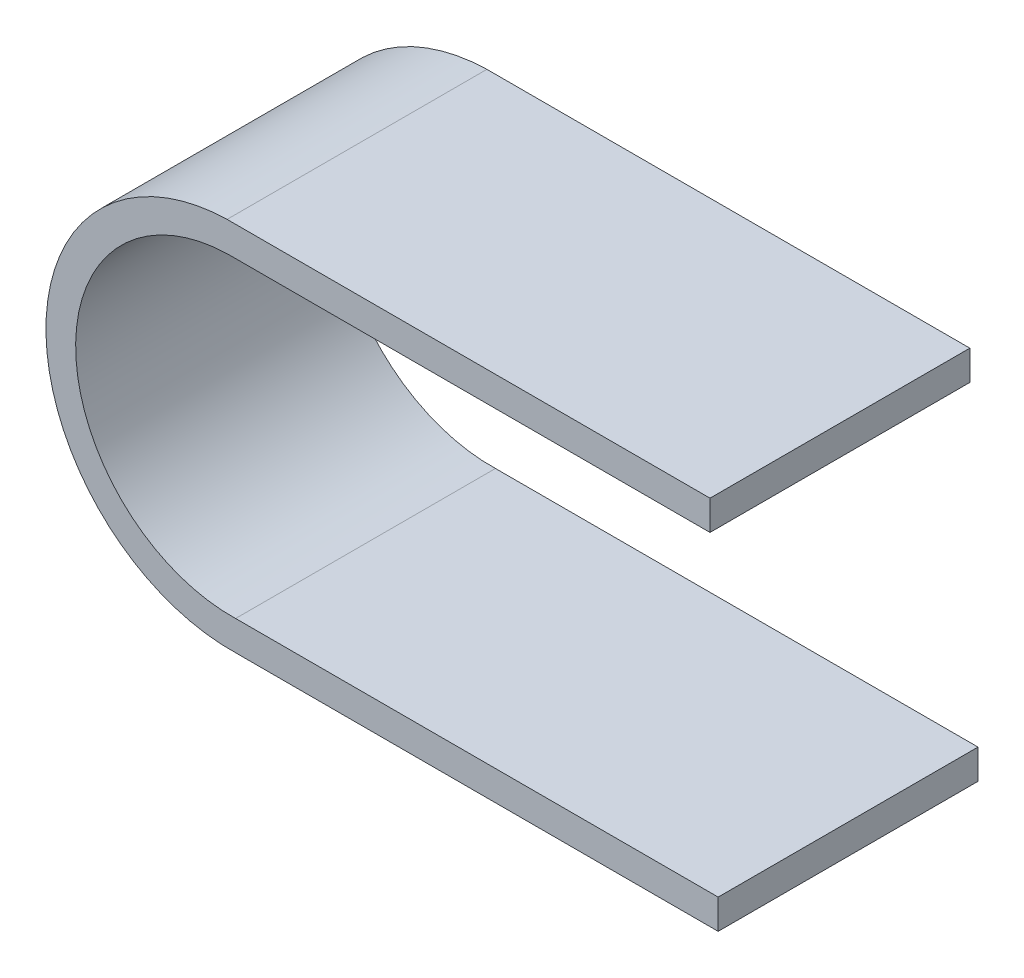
from build123d import *

# Parameters (mm, degrees)
BOSS_EXTRU_1_DEPTH = 35


with BuildPart() as part:
    # Esquisse1 → Boss.-Extru.1 (new body)
    with BuildSketch(Plane.XY):
        with BuildLine():
            Line((0, 0), (-65, 0))
            ThreePointArc((-65, 0), (-86.542158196, 20.44346889), (-66.098689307, 41.985627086))
            Line((-66.098689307, 41.985627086), (-1.098689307, 41.985627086))
            Line((-1.098689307, 41.985627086), (-1.098689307, 45.985627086))
            Line((-1.098689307, 45.985627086), (-66.148737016, 45.985627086))
            ThreePointArc((-66.148737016, 45.985627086), (-90.542158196, 20.393421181), (-64.949952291, -4))
            Line((-64.949952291, -4), (0, -4))
            Line((0, -4), (0, 0))
        make_face()
    extrude(amount=BOSS_EXTRU_1_DEPTH)


solid = part.part
